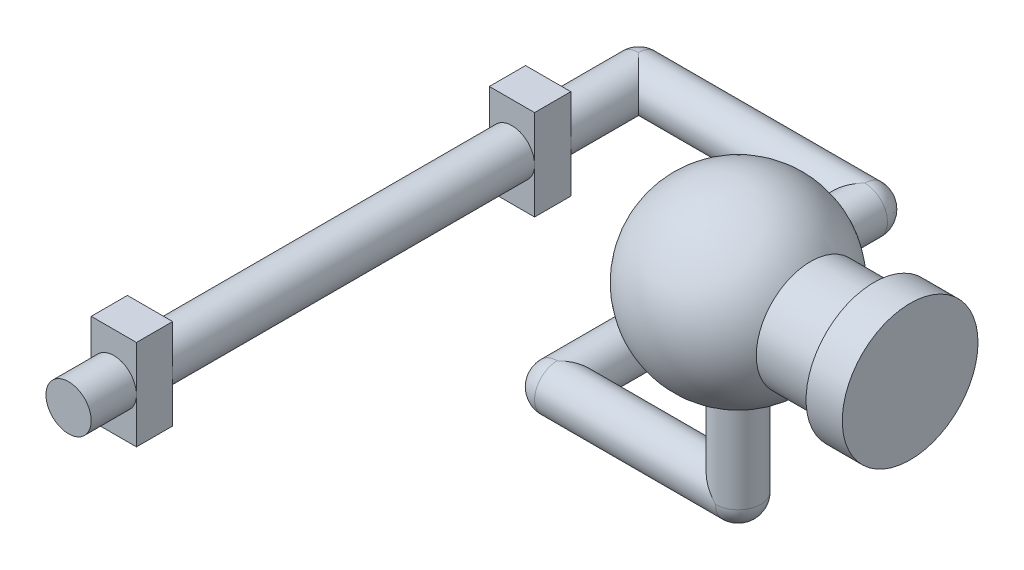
from build123d import *

# Parameters (mm, degrees)
ESQUISSE1_R             = 2.5
BASE_EXTRUSION_DEPTH    = 5
ESQUISSE2_W             = 5
ESQUISSE2_H             = 10
BOSS_EXTRU_1_DEPTH      = 4
BOSS_EXTRU_2_START      = 40
BOSS_EXTRU_2_DEPTH      = 40
ESQUISSE4_W             = 5
ESQUISSE4_H             = 10
BOSS_EXTRU_3_DEPTH      = 4
BOSS_EXTRU_4_START      = 10
BOSS_EXTRU_4_DEPTH      = 10
ESQUISSE6_R             = 2.5
BOSS_EXTRU_5_DEPTH      = 25
ESQUISSE7_R             = 2.5
BOSS_EXTRU_6_DEPTH      = 34
ESQUISSE8_R             = 2.5
BOSS_EXTRU_7_DEPTH      = 20
ESQUISSE9_R             = 2.5
BOSS_EXTRU_8_DEPTH      = 20
ESQUISSE13_R            = 6
BOSS_EXTRU_11_DEPTH     = 15
ESQUISSE14_R            = 7.5
BOSS_EXTRU_12_DEPTH     = 4
ENL_V_MAT_EXTRU_1_DEPTH = 10


with BuildPart() as part:
    # Esquisse1 → Base-Extrusion (new body)
    with BuildSketch(Plane.XY):
        Circle(ESQUISSE1_R)
    extrude(amount=BASE_EXTRUSION_DEPTH)

    # Esquisse2 → Boss.-Extru.1 (add)
    with BuildSketch(Plane(origin=(0, 0, 0), x_dir=(-1, 0, 0), z_dir=(0, 0, -1))):
        Rectangle(ESQUISSE2_W, ESQUISSE2_H)
    extrude(amount=BOSS_EXTRU_1_DEPTH)

    # Esquisse3 → Boss.-Extru.2 (add)
    with BuildSketch(Plane(origin=(0, 0, -4), x_dir=(-1, 0, 0), z_dir=(0, 0, -1)).offset(BOSS_EXTRU_2_START)):
        with BuildLine():
            ThreePointArc((2.5, 0), (0, 2.5), (-2.5, 0))
            ThreePointArc((-2.5, 0), (0, -2.5), (2.5, 0))
        make_face()
    extrude(amount=-BOSS_EXTRU_2_DEPTH)

    # Esquisse4 → Boss.-Extru.3 (add)
    with BuildSketch(Plane(origin=(0, 0, -44), x_dir=(-1, 0, 0), z_dir=(0, 0, -1))):
        Rectangle(ESQUISSE4_W, ESQUISSE4_H)
    extrude(amount=BOSS_EXTRU_3_DEPTH)

    # Esquisse5 → Boss.-Extru.4 (add)
    with BuildSketch(Plane(origin=(0, 0, -48), x_dir=(-1, 0, 0), z_dir=(0, 0, -1)).offset(BOSS_EXTRU_4_START)):
        with BuildLine():
            ThreePointArc((2.5, 0), (0, 2.5), (-2.5, 0))
            ThreePointArc((-2.5, 0), (0, -2.5), (2.5, 0))
        make_face()
    extrude(amount=-BOSS_EXTRU_4_DEPTH)

    # Esquisse6 → Boss.-Extru.5 (add)
    with BuildSketch(Plane(origin=(0, 0, 0), x_dir=(0, 0, -1), z_dir=(1, 0, 0))):
        with Locations(Location((58, 0, 0), (0, 0, 270))):
            Circle(ESQUISSE6_R)
    extrude(amount=BOSS_EXTRU_5_DEPTH)

    # Esquisse7 → Boss.-Extru.6 (add)
    with BuildSketch(Plane(origin=(0, 0, -58), x_dir=(-1, 0, 0), z_dir=(0, 0, -1))):
        with Locations(Location((-25, 0, 0), (0, 0, 270))):
            Circle(ESQUISSE7_R)
    extrude(amount=-BOSS_EXTRU_6_DEPTH)

    # Esquisse8 → Boss.-Extru.7 (add)
    with BuildSketch(Plane(origin=(25, 0, 0), x_dir=(0, 0, -1), z_dir=(1, 0, 0))):
        with Locations(Location((24, 0, 0), (0, 0, 180))):
            Circle(ESQUISSE8_R)
    extrude(amount=BOSS_EXTRU_7_DEPTH)

    # Esquisse9 → Boss.-Extru.8 (add)
    with BuildSketch(Plane(origin=(0, 0, 0), x_dir=(1, 0, 0), z_dir=(0, 1, 0))):
        with Locations(Location((45, 24, 0), (0, 0, 270))):
            Circle(ESQUISSE9_R)
    extrude(amount=BOSS_EXTRU_8_DEPTH)

    # Esquisse10 → Boss.-R_vol.1 (revolve)
    with BuildSketch(Plane(origin=(0, 20, 0), x_dir=(-1, 0, 0), z_dir=(0, 1, 0))):
        with BuildLine():
            Line((-45, -34), (-45, -14))
            ThreePointArc((-45, -14), (-55, -24), (-45, -34))
        make_face()
    revolve(axis=Axis((45, 20, -34.255897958), (0, 0, 1)))

    # Esquisse13 → Boss.-Extru.11 (add)
    with BuildSketch(Plane(origin=(45, 0, 0), x_dir=(0, 0, -1), z_dir=(1, 0, 0))):
        with Locations(Location((24, 20, 0), (0, 0, 180))):
            Circle(ESQUISSE13_R)
    extrude(amount=BOSS_EXTRU_11_DEPTH)

    # Esquisse14 → Boss.-Extru.12 (add)
    with BuildSketch(Plane(origin=(60, 0, 0), x_dir=(0, 0, -1), z_dir=(1, 0, 0))):
        with Locations((24, 20)):
            Circle(ESQUISSE14_R)
    extrude(amount=BOSS_EXTRU_12_DEPTH)

    # Esquisse15 → Boss.-R_vol.2 (revolve)
    with BuildSketch(Plane(origin=(0, 0, -58), x_dir=(-1, 0, 0), z_dir=(0, 0, -1))):
        with BuildLine():
            Line((-25, -2.5), (-25, 2.5))
            ThreePointArc((-25, 2.5), (-27.5, 0), (-25, -2.5))
        make_face()
    revolve(axis=Axis((25, 10.758262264, -58), (0, -1, 0)))

    # Esquisse16 → Boss.-R_vol.3 (revolve)
    with BuildSketch(Plane.XY.offset(-24)):
        with BuildLine():
            Line((25, -2.5), (25, 2.5))
            ThreePointArc((25, 2.5), (22.5, 0), (25, -2.5))
        make_face()
    revolve(axis=Axis((25, -7.054197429, -24), (0, 1, 0)))

    # Esquisse17 → Boss.-R_vol.4 (revolve)
    with BuildSketch(Plane(origin=(45, 0, 0), x_dir=(0, 0, -1), z_dir=(1, 0, 0))):
        with BuildLine():
            Line((26.5, 0), (21.5, 0))
            ThreePointArc((21.5, 0), (24, -2.5), (26.5, 0))
        make_face()
    revolve(axis=Axis((45, 0, -11.688346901), (0, 0, -1)))

    # Esquisse18 → Boss.-R_vol.5 (revolve)
    with BuildSketch(Plane(origin=(0, 0, -58), x_dir=(-1, 0, 0), z_dir=(0, 0, -1))):
        with BuildLine():
            Line((0, 2.5), (0, -2.5))
            ThreePointArc((0, -2.5), (2.5, 0), (0, 2.5))
        make_face()
    revolve(axis=Axis((0, 12.270359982, -58), (0, -1, 0)))

    # Esquisse19 → Enl_v. mat.-Extru.1 (cut)
    with BuildSketch(Plane.XY.offset(-24)):
        with BuildLine():
            Line((40.5164851, 15.363920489), (40.5164851, 24.609867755))
            Line((40.5164851, 24.609867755), (42.477915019, 24.609867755))
            Line((42.477915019, 24.609867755), (44.544917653, 18.121776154))
            add(Edge.make_bspline(
                [(44.544917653, 18.121776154), (44.567665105, 18.048277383), (44.611657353, 17.906135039), (44.676892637, 17.700868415), (44.736245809, 17.510119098), (44.789702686, 17.333279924), (44.840150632, 17.17122889), (44.883830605, 17.02263625), (44.925590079, 16.889153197), (44.950062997, 16.804320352), (44.961652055, 16.76414808)],
                knots=[0, 0, 0, 0, 1.300204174, 2.514519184, 3.639827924, 4.676153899, 5.636536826, 6.507959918, 7.293450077, 8, 8, 8, 8], degree=3))
            add(Edge.make_bspline(
                [(44.961652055, 16.76414808), (44.974559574, 16.807999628), (45.0020276, 16.901318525), (45.046557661, 17.048046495), (45.093938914, 17.210417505), (45.15063975, 17.385640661), (45.209743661, 17.576464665), (45.271780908, 17.782731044), (45.343339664, 18.002380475), (45.390894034, 18.154447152), (45.415429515, 18.232905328)],
                knots=[0, 0, 0, 0, 0.713638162, 1.518667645, 2.393860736, 3.354087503, 4.393659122, 5.512594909, 6.716633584, 8, 8, 8, 8], degree=3))
            Line((45.415429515, 18.232905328), (47.462058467, 24.609867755))
            Line((47.462058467, 24.609867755), (49.40681901, 24.609867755))
            Line((49.40681901, 24.609867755), (49.40681901, 15.363920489))
            Line((49.40681901, 15.363920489), (48.10290337, 15.363920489))
            Line((48.10290337, 15.363920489), (48.10290337, 23.187414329))
            Line((48.10290337, 23.187414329), (45.63583571, 15.363920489))
            Line((45.63583571, 15.363920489), (44.272651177, 15.363920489))
            Line((44.272651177, 15.363920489), (41.82040074, 23.187414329))
            Line((41.82040074, 23.187414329), (41.82040074, 15.363920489))
            Line((41.82040074, 15.363920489), (40.5164851, 15.363920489))
        make_face()
    extrude(amount=-ENL_V_MAT_EXTRU_1_DEPTH, mode=Mode.SUBTRACT)


solid = part.part
